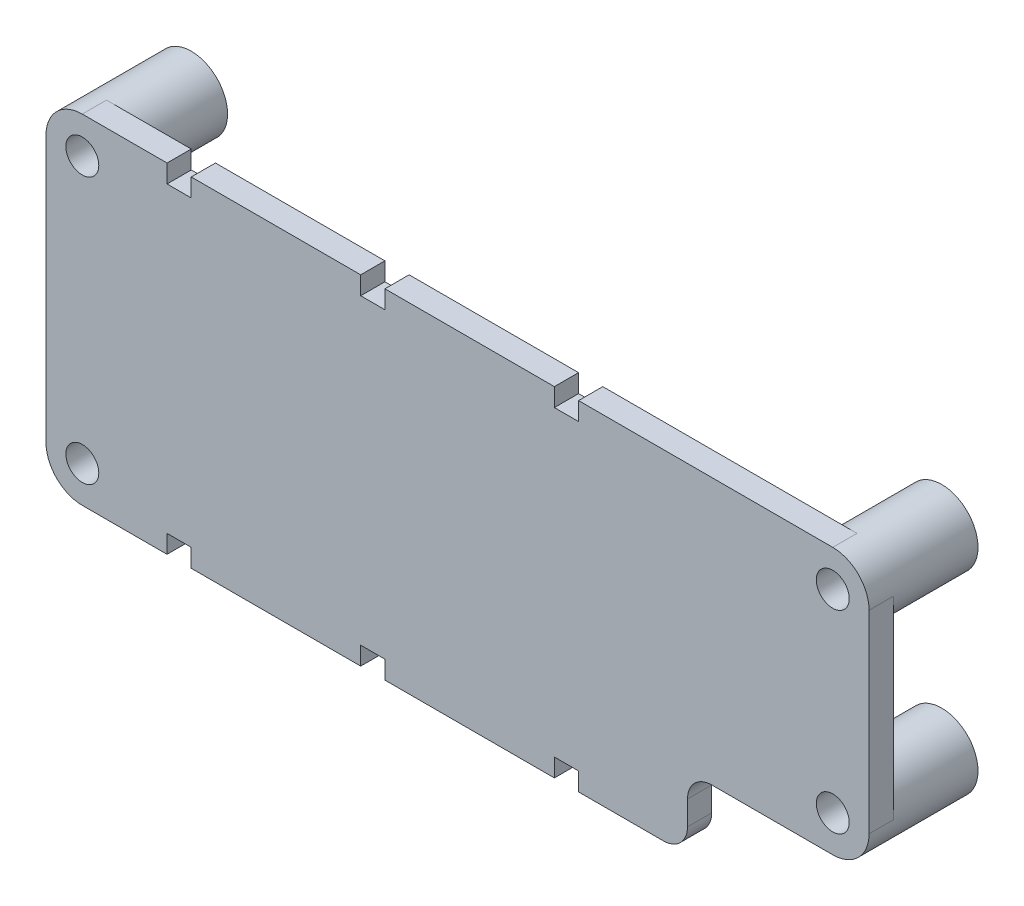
ISO-10303-21;
HEADER;
FILE_DESCRIPTION(('STEP AP214'),'2;1');
FILE_NAME('part.step','',(''),(''),'','','');
FILE_SCHEMA(('AUTOMOTIVE_DESIGN { 1 0 10303 214 1 1 1 1 }'));
ENDSEC;
DATA;
#1=APPLICATION_CONTEXT('core data for automotive mechanical design processes');
#2=APPLICATION_PROTOCOL_DEFINITION('international standard','automotive_design',2000,#1);
#3=PRODUCT_CONTEXT('',#1,'mechanical');
#4=PRODUCT('Part','Part','',(#3));
#5=PRODUCT_RELATED_PRODUCT_CATEGORY('part','',(#4));
#6=PRODUCT_DEFINITION_FORMATION('','',#4);
#7=PRODUCT_DEFINITION_CONTEXT('part definition',#1,'design');
#8=PRODUCT_DEFINITION('design','',#6,#7);
#9=PRODUCT_DEFINITION_SHAPE('','',#8);
#10=(LENGTH_UNIT() NAMED_UNIT(*) SI_UNIT(.MILLI.,.METRE.));
#11=(NAMED_UNIT(*) PLANE_ANGLE_UNIT() SI_UNIT($,.RADIAN.));
#12=(NAMED_UNIT(*) SI_UNIT($,.STERADIAN.) SOLID_ANGLE_UNIT());
#13=UNCERTAINTY_MEASURE_WITH_UNIT(LENGTH_MEASURE(1.E-05),#10,'distance_accuracy_value','');
#14=(GEOMETRIC_REPRESENTATION_CONTEXT(3) GLOBAL_UNCERTAINTY_ASSIGNED_CONTEXT((#13)) GLOBAL_UNIT_ASSIGNED_CONTEXT((#10,
#11,#12)) REPRESENTATION_CONTEXT('',''));
#15=CARTESIAN_POINT('',(0.,0.,0.));
#16=DIRECTION('',(0.,0.,1.));
#17=DIRECTION('',(1.,0.,0.));
#18=AXIS2_PLACEMENT_3D('',#15,#16,#17);
#19=CARTESIAN_POINT('',(-27.9400000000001,24.13,11.43));
#20=DIRECTION('',(0.,-1.,0.));
#21=DIRECTION('',(0.,0.,-1.));
#22=AXIS2_PLACEMENT_3D('',#19,#20,#21);
#23=PLANE('',#22);
#24=DIRECTION('',(-1.,0.,0.));
#25=VECTOR('',#24,1.);
#26=CARTESIAN_POINT('',(-27.9400000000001,24.13,11.43));
#27=LINE('',#26,#25);
#28=CARTESIAN_POINT('',(21.5899999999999,24.13,11.43));
#29=VERTEX_POINT('',#28);
#30=CARTESIAN_POINT('',(3.80999999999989,24.13,11.43));
#31=VERTEX_POINT('',#30);
#32=EDGE_CURVE('E465',#29,#31,#27,.T.);
#33=ORIENTED_EDGE('',*,*,#32,.F.);
#34=DIRECTION('',(0.,0.,1.));
#35=VECTOR('',#34,1.);
#36=CARTESIAN_POINT('',(21.5899999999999,24.13,5.715));
#37=LINE('',#36,#35);
#38=CARTESIAN_POINT('',(21.5899999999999,24.13,8.89));
#39=VERTEX_POINT('',#38);
#40=EDGE_CURVE('E297',#39,#29,#37,.T.);
#41=ORIENTED_EDGE('',*,*,#40,.F.);
#42=DIRECTION('',(-1.,0.,0.));
#43=VECTOR('',#42,1.);
#44=CARTESIAN_POINT('',(-27.9400000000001,24.13,8.89));
#45=LINE('',#44,#43);
#46=CARTESIAN_POINT('',(3.80999999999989,24.13,8.89));
#47=VERTEX_POINT('',#46);
#48=EDGE_CURVE('E37',#39,#47,#45,.T.);
#49=ORIENTED_EDGE('',*,*,#48,.T.);
#50=DIRECTION('',(0.,0.,1.));
#51=VECTOR('',#50,1.);
#52=CARTESIAN_POINT('',(3.80999999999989,24.13,5.715));
#53=LINE('',#52,#51);
#54=EDGE_CURVE('E363',#47,#31,#53,.T.);
#55=ORIENTED_EDGE('',*,*,#54,.T.);
#56=EDGE_LOOP('',(#33,#41,#49,#55));
#57=FACE_BOUND('',#56,.T.);
#58=ADVANCED_FACE('F33',(#57),#23,.F.);
#59=CARTESIAN_POINT('',(-27.9400000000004,-11.43,11.43));
#60=DIRECTION('',(0.,1.,0.));
#61=DIRECTION('',(0.,0.,1.));
#62=AXIS2_PLACEMENT_3D('',#59,#60,#61);
#63=PLANE('',#62);
#64=DIRECTION('',(1.,0.,0.));
#65=VECTOR('',#64,1.);
#66=CARTESIAN_POINT('',(-27.9400000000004,-11.43,8.89));
#67=LINE('',#66,#65);
#68=CARTESIAN_POINT('',(-16.5100000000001,-11.4299999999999,8.89));
#69=VERTEX_POINT('',#68);
#70=CARTESIAN_POINT('',(1.2699999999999,-11.4299999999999,8.89));
#71=VERTEX_POINT('',#70);
#72=EDGE_CURVE('E494',#69,#71,#67,.T.);
#73=ORIENTED_EDGE('',*,*,#72,.T.);
#74=DIRECTION('',(0.,0.,1.));
#75=VECTOR('',#74,1.);
#76=CARTESIAN_POINT('',(1.2699999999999,-11.4299999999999,5.715));
#77=LINE('',#76,#75);
#78=CARTESIAN_POINT('',(1.2699999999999,-11.4299999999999,11.43));
#79=VERTEX_POINT('',#78);
#80=EDGE_CURVE('E318',#71,#79,#77,.T.);
#81=ORIENTED_EDGE('',*,*,#80,.T.);
#82=DIRECTION('',(1.,0.,0.));
#83=VECTOR('',#82,1.);
#84=CARTESIAN_POINT('',(-27.9400000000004,-11.43,11.43));
#85=LINE('',#84,#83);
#86=CARTESIAN_POINT('',(-16.5100000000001,-11.43,11.43));
#87=VERTEX_POINT('',#86);
#88=EDGE_CURVE('E476',#87,#79,#85,.T.);
#89=ORIENTED_EDGE('',*,*,#88,.F.);
#90=DIRECTION('',(0.,0.,1.));
#91=VECTOR('',#90,1.);
#92=CARTESIAN_POINT('',(-16.5100000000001,-11.4299999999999,5.715));
#93=LINE('',#92,#91);
#94=EDGE_CURVE('E344',#69,#87,#93,.T.);
#95=ORIENTED_EDGE('',*,*,#94,.F.);
#96=EDGE_LOOP('',(#73,#81,#89,#95));
#97=FACE_BOUND('',#96,.T.);
#98=ADVANCED_FACE('F593',(#97),#63,.F.);
#99=CARTESIAN_POINT('',(-27.9400000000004,-11.4299999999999,8.89));
#100=VERTEX_POINT('',#99);
#101=CARTESIAN_POINT('',(-19.0500000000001,-11.4299999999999,8.89));
#102=VERTEX_POINT('',#101);
#103=EDGE_CURVE('E490',#100,#102,#67,.T.);
#104=ORIENTED_EDGE('',*,*,#103,.T.);
#105=DIRECTION('',(0.,0.,1.));
#106=VECTOR('',#105,1.);
#107=CARTESIAN_POINT('',(-19.0500000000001,-11.4299999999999,5.715));
#108=LINE('',#107,#106);
#109=CARTESIAN_POINT('',(-19.0500000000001,-11.4299999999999,11.43));
#110=VERTEX_POINT('',#109);
#111=EDGE_CURVE('E340',#102,#110,#108,.T.);
#112=ORIENTED_EDGE('',*,*,#111,.T.);
#113=CARTESIAN_POINT('',(-27.9400000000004,-11.4299999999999,11.43));
#114=VERTEX_POINT('',#113);
#115=EDGE_CURVE('E472',#114,#110,#85,.T.);
#116=ORIENTED_EDGE('',*,*,#115,.F.);
#117=DIRECTION('',(0.,0.,-1.));
#118=VECTOR('',#117,1.);
#119=CARTESIAN_POINT('',(-27.9400000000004,-11.4299999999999,11.43));
#120=LINE('',#119,#118);
#121=EDGE_CURVE('E527',#114,#100,#120,.T.);
#122=ORIENTED_EDGE('',*,*,#121,.T.);
#123=EDGE_LOOP('',(#104,#112,#116,#122));
#124=FACE_BOUND('',#123,.T.);
#125=ADVANCED_FACE('F706',(#124),#63,.F.);
#126=CARTESIAN_POINT('',(1.2699999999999,24.13,11.43));
#127=VERTEX_POINT('',#126);
#128=CARTESIAN_POINT('',(-16.5100000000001,24.13,11.43));
#129=VERTEX_POINT('',#128);
#130=EDGE_CURVE('E673',#127,#129,#27,.T.);
#131=ORIENTED_EDGE('',*,*,#130,.F.);
#132=DIRECTION('',(0.,0.,1.));
#133=VECTOR('',#132,1.);
#134=CARTESIAN_POINT('',(1.2699999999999,24.13,5.715));
#135=LINE('',#134,#133);
#136=CARTESIAN_POINT('',(1.2699999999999,24.13,8.89));
#137=VERTEX_POINT('',#136);
#138=EDGE_CURVE('E351',#137,#127,#135,.T.);
#139=ORIENTED_EDGE('',*,*,#138,.F.);
#140=CARTESIAN_POINT('',(-16.5100000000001,24.13,8.89));
#141=VERTEX_POINT('',#140);
#142=EDGE_CURVE('E553',#137,#141,#45,.T.);
#143=ORIENTED_EDGE('',*,*,#142,.T.);
#144=DIRECTION('',(0.,0.,1.));
#145=VECTOR('',#144,1.);
#146=CARTESIAN_POINT('',(-16.5100000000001,24.13,5.715));
#147=LINE('',#146,#145);
#148=EDGE_CURVE('E387',#141,#129,#147,.T.);
#149=ORIENTED_EDGE('',*,*,#148,.T.);
#150=EDGE_LOOP('',(#131,#139,#143,#149));
#151=FACE_BOUND('',#150,.T.);
#152=ADVANCED_FACE('F688',(#151),#23,.F.);
#153=CARTESIAN_POINT('',(-19.0500000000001,24.13,11.43));
#154=VERTEX_POINT('',#153);
#155=CARTESIAN_POINT('',(-27.9400000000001,24.13,11.43));
#156=VERTEX_POINT('',#155);
#157=EDGE_CURVE('E461',#154,#156,#27,.T.);
#158=ORIENTED_EDGE('',*,*,#157,.F.);
#159=DIRECTION('',(0.,0.,1.));
#160=VECTOR('',#159,1.);
#161=CARTESIAN_POINT('',(-19.0500000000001,24.13,5.715));
#162=LINE('',#161,#160);
#163=CARTESIAN_POINT('',(-19.0500000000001,24.13,8.89));
#164=VERTEX_POINT('',#163);
#165=EDGE_CURVE('E375',#164,#154,#162,.T.);
#166=ORIENTED_EDGE('',*,*,#165,.F.);
#167=CARTESIAN_POINT('',(-27.9400000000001,24.13,8.89));
#168=VERTEX_POINT('',#167);
#169=EDGE_CURVE('E456',#164,#168,#45,.T.);
#170=ORIENTED_EDGE('',*,*,#169,.T.);
#171=DIRECTION('',(0.,0.,-1.));
#172=VECTOR('',#171,1.);
#173=CARTESIAN_POINT('',(-27.9400000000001,24.13,11.43));
#174=LINE('',#173,#172);
#175=EDGE_CURVE('E537',#156,#168,#174,.T.);
#176=ORIENTED_EDGE('',*,*,#175,.F.);
#177=EDGE_LOOP('',(#158,#166,#170,#176));
#178=FACE_BOUND('',#177,.T.);
#179=ADVANCED_FACE('F563',(#178),#23,.F.);
#180=CARTESIAN_POINT('',(3.8099999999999,-11.43,11.43));
#181=VERTEX_POINT('',#180);
#182=CARTESIAN_POINT('',(21.5899999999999,-11.4299999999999,11.43));
#183=VERTEX_POINT('',#182);
#184=EDGE_CURVE('E477',#181,#183,#85,.T.);
#185=ORIENTED_EDGE('',*,*,#184,.F.);
#186=DIRECTION('',(0.,0.,1.));
#187=VECTOR('',#186,1.);
#188=CARTESIAN_POINT('',(3.8099999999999,-11.4299999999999,5.715));
#189=LINE('',#188,#187);
#190=CARTESIAN_POINT('',(3.8099999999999,-11.4299999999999,8.89));
#191=VERTEX_POINT('',#190);
#192=EDGE_CURVE('E59',#191,#181,#189,.T.);
#193=ORIENTED_EDGE('',*,*,#192,.F.);
#194=CARTESIAN_POINT('',(21.5899999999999,-11.4299999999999,8.89));
#195=VERTEX_POINT('',#194);
#196=EDGE_CURVE('E495',#191,#195,#67,.T.);
#197=ORIENTED_EDGE('',*,*,#196,.T.);
#198=DIRECTION('',(0.,0.,1.));
#199=VECTOR('',#198,1.);
#200=CARTESIAN_POINT('',(21.5899999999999,-11.4299999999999,5.715));
#201=LINE('',#200,#199);
#202=EDGE_CURVE('E412',#195,#183,#201,.T.);
#203=ORIENTED_EDGE('',*,*,#202,.T.);
#204=EDGE_LOOP('',(#185,#193,#197,#203));
#205=FACE_BOUND('',#204,.T.);
#206=ADVANCED_FACE('F720',(#205),#63,.F.);
#207=CARTESIAN_POINT('',(50.7999999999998,20.32,8.89));
#208=DIRECTION('',(0.,0.,1.));
#209=DIRECTION('',(1.,0.,0.));
#210=AXIS2_PLACEMENT_3D('',#207,#208,#209);
#211=PLANE('',#210);
#212=ORIENTED_EDGE('',*,*,#48,.F.);
#213=DIRECTION('',(0.,1.,0.));
#214=VECTOR('',#213,1.);
#215=CARTESIAN_POINT('',(21.5899999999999,24.13,8.89));
#216=LINE('',#215,#214);
#217=CARTESIAN_POINT('',(21.5899999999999,22.225,8.89));
#218=VERTEX_POINT('',#217);
#219=EDGE_CURVE('E303',#218,#39,#216,.T.);
#220=ORIENTED_EDGE('',*,*,#219,.F.);
#221=DIRECTION('',(-1.,0.,0.));
#222=VECTOR('',#221,1.);
#223=CARTESIAN_POINT('',(21.5899999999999,22.225,8.89));
#224=LINE('',#223,#222);
#225=CARTESIAN_POINT('',(24.1299999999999,22.225,8.89));
#226=VERTEX_POINT('',#225);
#227=EDGE_CURVE('E300',#226,#218,#224,.T.);
#228=ORIENTED_EDGE('',*,*,#227,.F.);
#229=DIRECTION('',(0.,-1.,0.));
#230=VECTOR('',#229,1.);
#231=CARTESIAN_POINT('',(24.1299999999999,24.13,8.89));
#232=LINE('',#231,#230);
#233=CARTESIAN_POINT('',(24.1299999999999,24.13,8.89));
#234=VERTEX_POINT('',#233);
#235=EDGE_CURVE('E277',#234,#226,#232,.T.);
#236=ORIENTED_EDGE('',*,*,#235,.F.);
#237=CARTESIAN_POINT('',(50.7999999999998,24.13,8.89));
#238=VERTEX_POINT('',#237);
#239=EDGE_CURVE('E542',#238,#234,#45,.T.);
#240=ORIENTED_EDGE('',*,*,#239,.F.);
#241=CARTESIAN_POINT('',(50.7999999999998,20.32,8.89));
#242=DIRECTION('',(0.,0.,1.));
#243=DIRECTION('',(1.,0.,0.));
#244=AXIS2_PLACEMENT_3D('',#241,#242,#243);
#245=CIRCLE('',#244,3.81);
#246=CARTESIAN_POINT('',(54.6099999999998,20.32,8.89));
#247=VERTEX_POINT('',#246);
#248=EDGE_CURVE('E449',#238,#247,#245,.T.);
#249=ORIENTED_EDGE('',*,*,#248,.T.);
#250=DIRECTION('',(0.,1.,0.));
#251=VECTOR('',#250,1.);
#252=CARTESIAN_POINT('',(54.6099999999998,20.32,8.89));
#253=LINE('',#252,#251);
#254=CARTESIAN_POINT('',(54.6099999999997,0.,8.89));
#255=VERTEX_POINT('',#254);
#256=EDGE_CURVE('E462',#255,#247,#253,.T.);
#257=ORIENTED_EDGE('',*,*,#256,.F.);
#258=CARTESIAN_POINT('',(50.7999999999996,0.,8.89));
#259=DIRECTION('',(0.,0.,1.));
#260=DIRECTION('',(1.,0.,0.));
#261=AXIS2_PLACEMENT_3D('',#258,#259,#260);
#262=CIRCLE('',#261,3.81);
#263=CARTESIAN_POINT('',(50.7999999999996,-3.81,8.89));
#264=VERTEX_POINT('',#263);
#265=EDGE_CURVE('E444',#255,#264,#262,.T.);
#266=ORIENTED_EDGE('',*,*,#265,.T.);
#267=DIRECTION('',(1.,0.,0.));
#268=VECTOR('',#267,1.);
#269=CARTESIAN_POINT('',(50.7999999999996,-3.81,8.89));
#270=LINE('',#269,#268);
#271=CARTESIAN_POINT('',(38.0999999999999,-3.81000000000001,8.89));
#272=VERTEX_POINT('',#271);
#273=EDGE_CURVE('E502',#272,#264,#270,.T.);
#274=ORIENTED_EDGE('',*,*,#273,.F.);
#275=CARTESIAN_POINT('',(38.0999999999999,-6.35000000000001,8.89));
#276=DIRECTION('',(0.,0.,-1.));
#277=DIRECTION('',(1.,0.,0.));
#278=AXIS2_PLACEMENT_3D('',#275,#276,#277);
#279=CIRCLE('',#278,2.54);
#280=CARTESIAN_POINT('',(35.5599999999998,-6.35000000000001,8.89));
#281=VERTEX_POINT('',#280);
#282=EDGE_CURVE('E500',#281,#272,#279,.T.);
#283=ORIENTED_EDGE('',*,*,#282,.F.);
#284=DIRECTION('',(0.,1.,0.));
#285=VECTOR('',#284,1.);
#286=CARTESIAN_POINT('',(35.5599999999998,-6.35000000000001,8.89));
#287=LINE('',#286,#285);
#288=CARTESIAN_POINT('',(35.5599999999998,-8.89,8.89));
#289=VERTEX_POINT('',#288);
#290=EDGE_CURVE('E498',#289,#281,#287,.T.);
#291=ORIENTED_EDGE('',*,*,#290,.F.);
#292=CARTESIAN_POINT('',(33.0199999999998,-8.89000000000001,8.89));
#293=DIRECTION('',(0.,0.,1.));
#294=DIRECTION('',(1.,0.,0.));
#295=AXIS2_PLACEMENT_3D('',#292,#293,#294);
#296=CIRCLE('',#295,2.54);
#297=CARTESIAN_POINT('',(33.0199999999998,-11.43,8.89));
#298=VERTEX_POINT('',#297);
#299=EDGE_CURVE('E493',#298,#289,#296,.T.);
#300=ORIENTED_EDGE('',*,*,#299,.F.);
#301=CARTESIAN_POINT('',(24.1299999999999,-11.4299999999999,8.89));
#302=VERTEX_POINT('',#301);
#303=EDGE_CURVE('E496',#302,#298,#67,.T.);
#304=ORIENTED_EDGE('',*,*,#303,.F.);
#305=DIRECTION('',(0.,-1.,0.));
#306=VECTOR('',#305,1.);
#307=CARTESIAN_POINT('',(24.1299999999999,-11.4299999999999,8.89));
#308=LINE('',#307,#306);
#309=CARTESIAN_POINT('',(24.1299999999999,-9.52499999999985,8.89));
#310=VERTEX_POINT('',#309);
#311=EDGE_CURVE('E396',#310,#302,#308,.T.);
#312=ORIENTED_EDGE('',*,*,#311,.F.);
#313=DIRECTION('',(1.,0.,0.));
#314=VECTOR('',#313,1.);
#315=CARTESIAN_POINT('',(21.5899999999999,-9.52499999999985,8.89));
#316=LINE('',#315,#314);
#317=CARTESIAN_POINT('',(21.5899999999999,-9.52499999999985,8.89));
#318=VERTEX_POINT('',#317);
#319=EDGE_CURVE('E398',#318,#310,#316,.T.);
#320=ORIENTED_EDGE('',*,*,#319,.F.);
#321=DIRECTION('',(0.,1.,0.));
#322=VECTOR('',#321,1.);
#323=CARTESIAN_POINT('',(21.5899999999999,-11.4299999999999,8.89));
#324=LINE('',#323,#322);
#325=EDGE_CURVE('E401',#195,#318,#324,.T.);
#326=ORIENTED_EDGE('',*,*,#325,.F.);
#327=ORIENTED_EDGE('',*,*,#196,.F.);
#328=DIRECTION('',(0.,-1.,0.));
#329=VECTOR('',#328,1.);
#330=CARTESIAN_POINT('',(3.8099999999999,-11.4299999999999,8.89));
#331=LINE('',#330,#329);
#332=CARTESIAN_POINT('',(3.8099999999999,-9.52499999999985,8.89));
#333=VERTEX_POINT('',#332);
#334=EDGE_CURVE('E304',#333,#191,#331,.T.);
#335=ORIENTED_EDGE('',*,*,#334,.F.);
#336=DIRECTION('',(1.,0.,0.));
#337=VECTOR('',#336,1.);
#338=CARTESIAN_POINT('',(1.2699999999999,-9.52499999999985,8.89));
#339=LINE('',#338,#337);
#340=CARTESIAN_POINT('',(1.2699999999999,-9.52499999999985,8.89));
#341=VERTEX_POINT('',#340);
#342=EDGE_CURVE('E306',#341,#333,#339,.T.);
#343=ORIENTED_EDGE('',*,*,#342,.F.);
#344=DIRECTION('',(0.,1.,0.));
#345=VECTOR('',#344,1.);
#346=CARTESIAN_POINT('',(1.2699999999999,-11.4299999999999,8.89));
#347=LINE('',#346,#345);
#348=EDGE_CURVE('E309',#71,#341,#347,.T.);
#349=ORIENTED_EDGE('',*,*,#348,.F.);
#350=ORIENTED_EDGE('',*,*,#72,.F.);
#351=DIRECTION('',(0.,-1.,0.));
#352=VECTOR('',#351,1.);
#353=CARTESIAN_POINT('',(-16.5100000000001,-11.4299999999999,8.89));
#354=LINE('',#353,#352);
#355=CARTESIAN_POINT('',(-16.5100000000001,-9.52499999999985,8.89));
#356=VERTEX_POINT('',#355);
#357=EDGE_CURVE('E325',#356,#69,#354,.T.);
#358=ORIENTED_EDGE('',*,*,#357,.F.);
#359=DIRECTION('',(1.,0.,0.));
#360=VECTOR('',#359,1.);
#361=CARTESIAN_POINT('',(-19.0500000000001,-9.52499999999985,8.89));
#362=LINE('',#361,#360);
#363=CARTESIAN_POINT('',(-19.0500000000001,-9.52499999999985,8.89));
#364=VERTEX_POINT('',#363);
#365=EDGE_CURVE('E327',#364,#356,#362,.T.);
#366=ORIENTED_EDGE('',*,*,#365,.F.);
#367=DIRECTION('',(0.,1.,0.));
#368=VECTOR('',#367,1.);
#369=CARTESIAN_POINT('',(-19.0500000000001,-11.4299999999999,8.89));
#370=LINE('',#369,#368);
#371=EDGE_CURVE('E330',#102,#364,#370,.T.);
#372=ORIENTED_EDGE('',*,*,#371,.F.);
#373=ORIENTED_EDGE('',*,*,#103,.F.);
#374=CARTESIAN_POINT('',(-27.9400000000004,-7.62000000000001,8.89));
#375=DIRECTION('',(0.,0.,1.));
#376=DIRECTION('',(1.,0.,0.));
#377=AXIS2_PLACEMENT_3D('',#374,#375,#376);
#378=CIRCLE('',#377,3.81);
#379=CARTESIAN_POINT('',(-31.7500000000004,-7.62000000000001,8.89));
#380=VERTEX_POINT('',#379);
#381=EDGE_CURVE('E454',#100,#380,#378,.T.);
#382=ORIENTED_EDGE('',*,*,#381,.T.);
#383=DIRECTION('',(0.,-1.,0.));
#384=VECTOR('',#383,1.);
#385=CARTESIAN_POINT('',(-31.7500000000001,20.32,8.89));
#386=LINE('',#385,#384);
#387=CARTESIAN_POINT('',(-31.7500000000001,20.32,8.89));
#388=VERTEX_POINT('',#387);
#389=EDGE_CURVE('E544',#388,#380,#386,.T.);
#390=ORIENTED_EDGE('',*,*,#389,.F.);
#391=CARTESIAN_POINT('',(-27.9400000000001,20.32,8.89));
#392=DIRECTION('',(0.,0.,1.));
#393=DIRECTION('',(1.,0.,0.));
#394=AXIS2_PLACEMENT_3D('',#391,#392,#393);
#395=CIRCLE('',#394,3.81);
#396=EDGE_CURVE('E11',#388,#168,#395,.T.);
#397=ORIENTED_EDGE('',*,*,#396,.T.);
#398=ORIENTED_EDGE('',*,*,#169,.F.);
#399=DIRECTION('',(0.,1.,0.));
#400=VECTOR('',#399,1.);
#401=CARTESIAN_POINT('',(-19.0500000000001,24.13,8.89));
#402=LINE('',#401,#400);
#403=CARTESIAN_POINT('',(-19.0500000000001,22.225,8.89));
#404=VERTEX_POINT('',#403);
#405=EDGE_CURVE('E374',#404,#164,#402,.T.);
#406=ORIENTED_EDGE('',*,*,#405,.F.);
#407=DIRECTION('',(-1.,0.,0.));
#408=VECTOR('',#407,1.);
#409=CARTESIAN_POINT('',(-19.0500000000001,22.225,8.89));
#410=LINE('',#409,#408);
#411=CARTESIAN_POINT('',(-16.5100000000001,22.225,8.89));
#412=VERTEX_POINT('',#411);
#413=EDGE_CURVE('E377',#412,#404,#410,.T.);
#414=ORIENTED_EDGE('',*,*,#413,.F.);
#415=DIRECTION('',(0.,-1.,0.));
#416=VECTOR('',#415,1.);
#417=CARTESIAN_POINT('',(-16.5100000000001,24.13,8.89));
#418=LINE('',#417,#416);
#419=EDGE_CURVE('E372',#141,#412,#418,.T.);
#420=ORIENTED_EDGE('',*,*,#419,.F.);
#421=ORIENTED_EDGE('',*,*,#142,.F.);
#422=DIRECTION('',(0.,1.,0.));
#423=VECTOR('',#422,1.);
#424=CARTESIAN_POINT('',(1.2699999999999,24.13,8.89));
#425=LINE('',#424,#423);
#426=CARTESIAN_POINT('',(1.2699999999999,22.225,8.89));
#427=VERTEX_POINT('',#426);
#428=EDGE_CURVE('E350',#427,#137,#425,.T.);
#429=ORIENTED_EDGE('',*,*,#428,.F.);
#430=DIRECTION('',(-1.,0.,0.));
#431=VECTOR('',#430,1.);
#432=CARTESIAN_POINT('',(1.2699999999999,22.225,8.89));
#433=LINE('',#432,#431);
#434=CARTESIAN_POINT('',(3.80999999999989,22.225,8.89));
#435=VERTEX_POINT('',#434);
#436=EDGE_CURVE('E353',#435,#427,#433,.T.);
#437=ORIENTED_EDGE('',*,*,#436,.F.);
#438=DIRECTION('',(0.,-1.,0.));
#439=VECTOR('',#438,1.);
#440=CARTESIAN_POINT('',(3.80999999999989,24.13,8.89));
#441=LINE('',#440,#439);
#442=EDGE_CURVE('E348',#47,#435,#441,.T.);
#443=ORIENTED_EDGE('',*,*,#442,.F.);
#444=EDGE_LOOP('',(#212,#220,#228,#236,#240,#249,#257,#266,#274,#283,#291,#300,#304,#312,#320,
#326,#327,#335,#343,#349,#350,#358,#366,#372,#373,#382,#390,#397,#398,#406,#414,#420,#421,#429,
#437,#443));
#445=FACE_BOUND('',#444,.T.);
#446=ADVANCED_FACE('F570',(#445),#211,.F.);
#447=CARTESIAN_POINT('',(-27.9400000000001,20.32,8.89));
#448=DIRECTION('',(0.,0.,-1.));
#449=DIRECTION('',(-1.,0.,0.));
#450=AXIS2_PLACEMENT_3D('',#447,#448,#449);
#451=CYLINDRICAL_SURFACE('',#450,3.81);
#452=ORIENTED_EDGE('',*,*,#396,.F.);
#453=DIRECTION('',(0.,0.,-1.));
#454=VECTOR('',#453,1.);
#455=CARTESIAN_POINT('',(-31.7500000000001,20.32,11.43));
#456=LINE('',#455,#454);
#457=CARTESIAN_POINT('',(-31.7500000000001,20.32,11.43));
#458=VERTEX_POINT('',#457);
#459=EDGE_CURVE('E533',#458,#388,#456,.T.);
#460=ORIENTED_EDGE('',*,*,#459,.F.);
#461=CARTESIAN_POINT('',(-27.9400000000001,20.32,11.43));
#462=DIRECTION('',(0.,0.,1.));
#463=DIRECTION('',(1.,0.,0.));
#464=AXIS2_PLACEMENT_3D('',#461,#462,#463);
#465=CIRCLE('',#464,3.81);
#466=EDGE_CURVE('E464',#156,#458,#465,.T.);
#467=ORIENTED_EDGE('',*,*,#466,.F.);
#468=ORIENTED_EDGE('',*,*,#175,.T.);
#469=EDGE_LOOP('',(#452,#460,#467,#468));
#470=FACE_BOUND('',#469,.T.);
#471=CARTESIAN_POINT('',(-27.9400000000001,20.32,0.));
#472=DIRECTION('',(0.,0.,1.));
#473=DIRECTION('',(1.,0.,0.));
#474=AXIS2_PLACEMENT_3D('',#471,#472,#473);
#475=CIRCLE('',#474,3.81);
#476=CARTESIAN_POINT('',(-24.1300000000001,20.32,0.));
#477=VERTEX_POINT('',#476);
#478=EDGE_CURVE('E43',#477,#477,#475,.T.);
#479=ORIENTED_EDGE('',*,*,#478,.T.);
#480=EDGE_LOOP('',(#479));
#481=FACE_BOUND('',#480,.T.);
#482=ADVANCED_FACE('F35',(#470,#481),#451,.T.);
#483=CARTESIAN_POINT('',(-27.9400000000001,20.32,0.));
#484=DIRECTION('',(0.,0.,1.));
#485=DIRECTION('',(1.,0.,0.));
#486=AXIS2_PLACEMENT_3D('',#483,#484,#485);
#487=PLANE('',#486);
#488=CARTESIAN_POINT('',(-27.9400000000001,20.32,0.));
#489=DIRECTION('',(0.,0.,1.));
#490=DIRECTION('',(1.,0.,0.));
#491=AXIS2_PLACEMENT_3D('',#488,#489,#490);
#492=CIRCLE('',#491,1.7272);
#493=CARTESIAN_POINT('',(-26.2128000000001,20.32,0.));
#494=VERTEX_POINT('',#493);
#495=EDGE_CURVE('E422',#494,#494,#492,.T.);
#496=ORIENTED_EDGE('',*,*,#495,.T.);
#497=EDGE_LOOP('',(#496));
#498=FACE_BOUND('',#497,.T.);
#499=ORIENTED_EDGE('',*,*,#478,.F.);
#500=EDGE_LOOP('',(#499));
#501=FACE_BOUND('',#500,.T.);
#502=ADVANCED_FACE('F718',(#498,#501),#487,.F.);
#503=CARTESIAN_POINT('',(50.7999999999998,20.32,11.43));
#504=DIRECTION('',(0.,0.,-1.));
#505=DIRECTION('',(-1.,0.,0.));
#506=AXIS2_PLACEMENT_3D('',#503,#504,#505);
#507=CYLINDRICAL_SURFACE('',#506,3.81);
#508=DIRECTION('',(0.,0.,-1.));
#509=VECTOR('',#508,1.);
#510=CARTESIAN_POINT('',(54.6099999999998,20.32,11.43));
#511=LINE('',#510,#509);
#512=CARTESIAN_POINT('',(54.6099999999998,20.32,11.43));
#513=VERTEX_POINT('',#512);
#514=EDGE_CURVE('E489',#513,#247,#511,.T.);
#515=ORIENTED_EDGE('',*,*,#514,.T.);
#516=ORIENTED_EDGE('',*,*,#248,.F.);
#517=DIRECTION('',(0.,0.,-1.));
#518=VECTOR('',#517,1.);
#519=CARTESIAN_POINT('',(50.7999999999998,24.13,11.43));
#520=LINE('',#519,#518);
#521=CARTESIAN_POINT('',(50.7999999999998,24.13,11.43));
#522=VERTEX_POINT('',#521);
#523=EDGE_CURVE('E534',#522,#238,#520,.T.);
#524=ORIENTED_EDGE('',*,*,#523,.F.);
#525=CARTESIAN_POINT('',(50.7999999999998,20.32,11.43));
#526=DIRECTION('',(0.,0.,1.));
#527=DIRECTION('',(1.,0.,0.));
#528=AXIS2_PLACEMENT_3D('',#525,#526,#527);
#529=CIRCLE('',#528,3.81);
#530=EDGE_CURVE('E459',#513,#522,#529,.T.);
#531=ORIENTED_EDGE('',*,*,#530,.F.);
#532=EDGE_LOOP('',(#515,#516,#524,#531));
#533=FACE_BOUND('',#532,.T.);
#534=CARTESIAN_POINT('',(50.7999999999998,20.32,0.));
#535=DIRECTION('',(0.,0.,1.));
#536=DIRECTION('',(1.,0.,0.));
#537=AXIS2_PLACEMENT_3D('',#534,#535,#536);
#538=CIRCLE('',#537,3.81);
#539=CARTESIAN_POINT('',(54.6099999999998,20.32,0.));
#540=VERTEX_POINT('',#539);
#541=EDGE_CURVE('E446',#540,#540,#538,.T.);
#542=ORIENTED_EDGE('',*,*,#541,.T.);
#543=EDGE_LOOP('',(#542));
#544=FACE_BOUND('',#543,.T.);
#545=ADVANCED_FACE('F648',(#533,#544),#507,.T.);
#546=ORIENTED_EDGE('',*,*,#239,.T.);
#547=DIRECTION('',(0.,0.,1.));
#548=VECTOR('',#547,1.);
#549=CARTESIAN_POINT('',(24.1299999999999,24.13,5.715));
#550=LINE('',#549,#548);
#551=CARTESIAN_POINT('',(24.1299999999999,24.13,11.43));
#552=VERTEX_POINT('',#551);
#553=EDGE_CURVE('E280',#234,#552,#550,.T.);
#554=ORIENTED_EDGE('',*,*,#553,.T.);
#555=EDGE_CURVE('E292',#522,#552,#27,.T.);
#556=ORIENTED_EDGE('',*,*,#555,.F.);
#557=ORIENTED_EDGE('',*,*,#523,.T.);
#558=EDGE_LOOP('',(#546,#554,#556,#557));
#559=FACE_BOUND('',#558,.T.);
#560=ADVANCED_FACE('F652',(#559),#23,.F.);
#561=CARTESIAN_POINT('',(-31.7500000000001,20.32,11.43));
#562=DIRECTION('',(1.,0.,0.));
#563=DIRECTION('',(0.,1.,0.));
#564=AXIS2_PLACEMENT_3D('',#561,#562,#563);
#565=PLANE('',#564);
#566=ORIENTED_EDGE('',*,*,#389,.T.);
#567=DIRECTION('',(0.,0.,-1.));
#568=VECTOR('',#567,1.);
#569=CARTESIAN_POINT('',(-31.7500000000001,-7.62000000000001,11.43));
#570=LINE('',#569,#568);
#571=CARTESIAN_POINT('',(-31.7500000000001,-7.62000000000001,11.43));
#572=VERTEX_POINT('',#571);
#573=EDGE_CURVE('E530',#572,#380,#570,.T.);
#574=ORIENTED_EDGE('',*,*,#573,.F.);
#575=DIRECTION('',(0.,-1.,0.));
#576=VECTOR('',#575,1.);
#577=CARTESIAN_POINT('',(-31.7500000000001,20.32,11.43));
#578=LINE('',#577,#576);
#579=EDGE_CURVE('E467',#458,#572,#578,.T.);
#580=ORIENTED_EDGE('',*,*,#579,.F.);
#581=ORIENTED_EDGE('',*,*,#459,.T.);
#582=EDGE_LOOP('',(#566,#574,#580,#581));
#583=FACE_BOUND('',#582,.T.);
#584=ADVANCED_FACE('F712',(#583),#565,.F.);
#585=CARTESIAN_POINT('',(-27.9400000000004,-7.62000000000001,11.43));
#586=DIRECTION('',(0.,0.,-1.));
#587=DIRECTION('',(-1.,0.,0.));
#588=AXIS2_PLACEMENT_3D('',#585,#586,#587);
#589=CYLINDRICAL_SURFACE('',#588,3.80999999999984);
#590=ORIENTED_EDGE('',*,*,#573,.T.);
#591=ORIENTED_EDGE('',*,*,#381,.F.);
#592=ORIENTED_EDGE('',*,*,#121,.F.);
#593=CARTESIAN_POINT('',(-27.9400000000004,-7.62000000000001,11.43));
#594=DIRECTION('',(0.,0.,1.));
#595=DIRECTION('',(1.,0.,0.));
#596=AXIS2_PLACEMENT_3D('',#593,#594,#595);
#597=CIRCLE('',#596,3.80999999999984);
#598=EDGE_CURVE('E469',#572,#114,#597,.T.);
#599=ORIENTED_EDGE('',*,*,#598,.F.);
#600=EDGE_LOOP('',(#590,#591,#592,#599));
#601=FACE_BOUND('',#600,.T.);
#602=CARTESIAN_POINT('',(-27.9400000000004,-7.62000000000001,0.));
#603=DIRECTION('',(0.,0.,1.));
#604=DIRECTION('',(1.,0.,0.));
#605=AXIS2_PLACEMENT_3D('',#602,#603,#604);
#606=CIRCLE('',#605,3.81);
#607=CARTESIAN_POINT('',(-24.1300000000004,-7.62000000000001,0.));
#608=VERTEX_POINT('',#607);
#609=EDGE_CURVE('E451',#608,#608,#606,.T.);
#610=ORIENTED_EDGE('',*,*,#609,.T.);
#611=EDGE_LOOP('',(#610));
#612=FACE_BOUND('',#611,.T.);
#613=ADVANCED_FACE('F717',(#601,#612),#589,.T.);
#614=CARTESIAN_POINT('',(24.1299999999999,-11.43,11.43));
#615=VERTEX_POINT('',#614);
#616=CARTESIAN_POINT('',(33.0199999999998,-11.43,11.43));
#617=VERTEX_POINT('',#616);
#618=EDGE_CURVE('E471',#615,#617,#85,.T.);
#619=ORIENTED_EDGE('',*,*,#618,.F.);
#620=DIRECTION('',(0.,0.,1.));
#621=VECTOR('',#620,1.);
#622=CARTESIAN_POINT('',(24.1299999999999,-11.4299999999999,5.715));
#623=LINE('',#622,#621);
#624=EDGE_CURVE('E416',#302,#615,#623,.T.);
#625=ORIENTED_EDGE('',*,*,#624,.F.);
#626=ORIENTED_EDGE('',*,*,#303,.T.);
#627=DIRECTION('',(0.,0.,-1.));
#628=VECTOR('',#627,1.);
#629=CARTESIAN_POINT('',(33.0199999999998,-11.43,11.43));
#630=LINE('',#629,#628);
#631=EDGE_CURVE('E524',#617,#298,#630,.T.);
#632=ORIENTED_EDGE('',*,*,#631,.F.);
#633=EDGE_LOOP('',(#619,#625,#626,#632));
#634=FACE_BOUND('',#633,.T.);
#635=ADVANCED_FACE('F616',(#634),#63,.F.);
#636=CARTESIAN_POINT('',(33.0199999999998,-8.89000000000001,11.43));
#637=DIRECTION('',(0.,0.,-1.));
#638=DIRECTION('',(-1.,0.,0.));
#639=AXIS2_PLACEMENT_3D('',#636,#637,#638);
#640=CYLINDRICAL_SURFACE('',#639,2.54);
#641=ORIENTED_EDGE('',*,*,#299,.T.);
#642=DIRECTION('',(0.,0.,-1.));
#643=VECTOR('',#642,1.);
#644=CARTESIAN_POINT('',(35.5599999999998,-8.89,11.43));
#645=LINE('',#644,#643);
#646=CARTESIAN_POINT('',(35.5599999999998,-8.89,11.43));
#647=VERTEX_POINT('',#646);
#648=EDGE_CURVE('E521',#647,#289,#645,.T.);
#649=ORIENTED_EDGE('',*,*,#648,.F.);
#650=CARTESIAN_POINT('',(33.0199999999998,-8.89000000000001,11.43));
#651=DIRECTION('',(0.,0.,1.));
#652=DIRECTION('',(1.,0.,0.));
#653=AXIS2_PLACEMENT_3D('',#650,#651,#652);
#654=CIRCLE('',#653,2.54);
#655=EDGE_CURVE('E475',#617,#647,#654,.T.);
#656=ORIENTED_EDGE('',*,*,#655,.F.);
#657=ORIENTED_EDGE('',*,*,#631,.T.);
#658=EDGE_LOOP('',(#641,#649,#656,#657));
#659=FACE_BOUND('',#658,.T.);
#660=ADVANCED_FACE('F619',(#659),#640,.T.);
#661=CARTESIAN_POINT('',(35.5599999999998,-6.35000000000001,11.43));
#662=DIRECTION('',(-1.,0.,0.));
#663=DIRECTION('',(0.,0.,1.));
#664=AXIS2_PLACEMENT_3D('',#661,#662,#663);
#665=PLANE('',#664);
#666=ORIENTED_EDGE('',*,*,#290,.T.);
#667=DIRECTION('',(0.,0.,-1.));
#668=VECTOR('',#667,1.);
#669=CARTESIAN_POINT('',(35.5599999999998,-6.35000000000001,11.43));
#670=LINE('',#669,#668);
#671=CARTESIAN_POINT('',(35.5599999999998,-6.35000000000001,11.43));
#672=VERTEX_POINT('',#671);
#673=EDGE_CURVE('E518',#672,#281,#670,.T.);
#674=ORIENTED_EDGE('',*,*,#673,.F.);
#675=DIRECTION('',(0.,1.,0.));
#676=VECTOR('',#675,1.);
#677=CARTESIAN_POINT('',(35.5599999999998,-6.35000000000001,11.43));
#678=LINE('',#677,#676);
#679=EDGE_CURVE('E479',#647,#672,#678,.T.);
#680=ORIENTED_EDGE('',*,*,#679,.F.);
#681=ORIENTED_EDGE('',*,*,#648,.T.);
#682=EDGE_LOOP('',(#666,#674,#680,#681));
#683=FACE_BOUND('',#682,.T.);
#684=ADVANCED_FACE('F624',(#683),#665,.F.);
#685=CARTESIAN_POINT('',(38.0999999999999,-6.35000000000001,11.43));
#686=DIRECTION('',(0.,0.,-1.));
#687=DIRECTION('',(-1.,0.,0.));
#688=AXIS2_PLACEMENT_3D('',#685,#686,#687);
#689=CYLINDRICAL_SURFACE('',#688,2.54);
#690=ORIENTED_EDGE('',*,*,#282,.T.);
#691=DIRECTION('',(0.,0.,-1.));
#692=VECTOR('',#691,1.);
#693=CARTESIAN_POINT('',(38.0999999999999,-3.81000000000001,11.43));
#694=LINE('',#693,#692);
#695=CARTESIAN_POINT('',(38.0999999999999,-3.81000000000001,11.43));
#696=VERTEX_POINT('',#695);
#697=EDGE_CURVE('E515',#696,#272,#694,.T.);
#698=ORIENTED_EDGE('',*,*,#697,.F.);
#699=CARTESIAN_POINT('',(38.0999999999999,-6.35000000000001,11.43));
#700=DIRECTION('',(0.,0.,-1.));
#701=DIRECTION('',(1.,0.,0.));
#702=AXIS2_PLACEMENT_3D('',#699,#700,#701);
#703=CIRCLE('',#702,2.54);
#704=EDGE_CURVE('E481',#672,#696,#703,.T.);
#705=ORIENTED_EDGE('',*,*,#704,.F.);
#706=ORIENTED_EDGE('',*,*,#673,.T.);
#707=EDGE_LOOP('',(#690,#698,#705,#706));
#708=FACE_BOUND('',#707,.T.);
#709=ADVANCED_FACE('F630',(#708),#689,.F.);
#710=CARTESIAN_POINT('',(50.7999999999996,-3.81,11.43));
#711=DIRECTION('',(0.,1.,0.));
#712=DIRECTION('',(-1.,0.,0.));
#713=AXIS2_PLACEMENT_3D('',#710,#711,#712);
#714=PLANE('',#713);
#715=ORIENTED_EDGE('',*,*,#273,.T.);
#716=DIRECTION('',(0.,0.,-1.));
#717=VECTOR('',#716,1.);
#718=CARTESIAN_POINT('',(50.7999999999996,-3.81,11.43));
#719=LINE('',#718,#717);
#720=CARTESIAN_POINT('',(50.7999999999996,-3.81,11.43));
#721=VERTEX_POINT('',#720);
#722=EDGE_CURVE('E512',#721,#264,#719,.T.);
#723=ORIENTED_EDGE('',*,*,#722,.F.);
#724=DIRECTION('',(1.,0.,0.));
#725=VECTOR('',#724,1.);
#726=CARTESIAN_POINT('',(50.7999999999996,-3.81,11.43));
#727=LINE('',#726,#725);
#728=EDGE_CURVE('E483',#696,#721,#727,.T.);
#729=ORIENTED_EDGE('',*,*,#728,.F.);
#730=ORIENTED_EDGE('',*,*,#697,.T.);
#731=EDGE_LOOP('',(#715,#723,#729,#730));
#732=FACE_BOUND('',#731,.T.);
#733=ADVANCED_FACE('F634',(#732),#714,.F.);
#734=CARTESIAN_POINT('',(50.7999999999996,0.,11.43));
#735=DIRECTION('',(0.,0.,-1.));
#736=DIRECTION('',(-1.,0.,0.));
#737=AXIS2_PLACEMENT_3D('',#734,#735,#736);
#738=CYLINDRICAL_SURFACE('',#737,3.81000000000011);
#739=ORIENTED_EDGE('',*,*,#722,.T.);
#740=ORIENTED_EDGE('',*,*,#265,.F.);
#741=DIRECTION('',(0.,0.,-1.));
#742=VECTOR('',#741,1.);
#743=CARTESIAN_POINT('',(54.6099999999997,0.,11.43));
#744=LINE('',#743,#742);
#745=CARTESIAN_POINT('',(54.6099999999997,0.,11.43));
#746=VERTEX_POINT('',#745);
#747=EDGE_CURVE('E509',#746,#255,#744,.T.);
#748=ORIENTED_EDGE('',*,*,#747,.F.);
#749=CARTESIAN_POINT('',(50.7999999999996,0.,11.43));
#750=DIRECTION('',(0.,0.,1.));
#751=DIRECTION('',(1.,0.,0.));
#752=AXIS2_PLACEMENT_3D('',#749,#750,#751);
#753=CIRCLE('',#752,3.81000000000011);
#754=EDGE_CURVE('E485',#721,#746,#753,.T.);
#755=ORIENTED_EDGE('',*,*,#754,.F.);
#756=EDGE_LOOP('',(#739,#740,#748,#755));
#757=FACE_BOUND('',#756,.T.);
#758=CARTESIAN_POINT('',(50.7999999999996,0.,0.));
#759=DIRECTION('',(0.,0.,1.));
#760=DIRECTION('',(1.,0.,0.));
#761=AXIS2_PLACEMENT_3D('',#758,#759,#760);
#762=CIRCLE('',#761,3.81);
#763=CARTESIAN_POINT('',(54.6099999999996,0.,0.));
#764=VERTEX_POINT('',#763);
#765=EDGE_CURVE('E443',#764,#764,#762,.T.);
#766=ORIENTED_EDGE('',*,*,#765,.T.);
#767=EDGE_LOOP('',(#766));
#768=FACE_BOUND('',#767,.T.);
#769=ADVANCED_FACE('F638',(#757,#768),#738,.T.);
#770=CARTESIAN_POINT('',(54.6099999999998,20.32,11.43));
#771=DIRECTION('',(-1.,0.,0.));
#772=DIRECTION('',(0.,-1.,0.));
#773=AXIS2_PLACEMENT_3D('',#770,#771,#772);
#774=PLANE('',#773);
#775=ORIENTED_EDGE('',*,*,#256,.T.);
#776=ORIENTED_EDGE('',*,*,#514,.F.);
#777=DIRECTION('',(0.,1.,0.));
#778=VECTOR('',#777,1.);
#779=CARTESIAN_POINT('',(54.6099999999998,20.32,11.43));
#780=LINE('',#779,#778);
#781=EDGE_CURVE('E487',#746,#513,#780,.T.);
#782=ORIENTED_EDGE('',*,*,#781,.F.);
#783=ORIENTED_EDGE('',*,*,#747,.T.);
#784=EDGE_LOOP('',(#775,#776,#782,#783));
#785=FACE_BOUND('',#784,.T.);
#786=ADVANCED_FACE('F645',(#785),#774,.F.);
#787=CARTESIAN_POINT('',(50.7999999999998,20.32,11.43));
#788=DIRECTION('',(0.,0.,1.));
#789=DIRECTION('',(1.,0.,0.));
#790=AXIS2_PLACEMENT_3D('',#787,#788,#789);
#791=PLANE('',#790);
#792=DIRECTION('',(0.,-1.,0.));
#793=VECTOR('',#792,1.);
#794=CARTESIAN_POINT('',(21.5899999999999,24.13,11.43));
#795=LINE('',#794,#793);
#796=CARTESIAN_POINT('',(21.5899999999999,22.225,11.43));
#797=VERTEX_POINT('',#796);
#798=EDGE_CURVE('E51',#29,#797,#795,.T.);
#799=ORIENTED_EDGE('',*,*,#798,.F.);
#800=ORIENTED_EDGE('',*,*,#32,.T.);
#801=DIRECTION('',(0.,1.,0.));
#802=VECTOR('',#801,1.);
#803=CARTESIAN_POINT('',(3.80999999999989,24.13,11.43));
#804=LINE('',#803,#802);
#805=CARTESIAN_POINT('',(3.80999999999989,22.225,11.43));
#806=VERTEX_POINT('',#805);
#807=EDGE_CURVE('E358',#806,#31,#804,.T.);
#808=ORIENTED_EDGE('',*,*,#807,.F.);
#809=DIRECTION('',(1.,0.,0.));
#810=VECTOR('',#809,1.);
#811=CARTESIAN_POINT('',(1.2699999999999,22.225,11.43));
#812=LINE('',#811,#810);
#813=CARTESIAN_POINT('',(1.2699999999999,22.225,11.43));
#814=VERTEX_POINT('',#813);
#815=EDGE_CURVE('E355',#814,#806,#812,.T.);
#816=ORIENTED_EDGE('',*,*,#815,.F.);
#817=DIRECTION('',(0.,-1.,0.));
#818=VECTOR('',#817,1.);
#819=CARTESIAN_POINT('',(1.2699999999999,24.13,11.43));
#820=LINE('',#819,#818);
#821=EDGE_CURVE('E332',#127,#814,#820,.T.);
#822=ORIENTED_EDGE('',*,*,#821,.F.);
#823=ORIENTED_EDGE('',*,*,#130,.T.);
#824=DIRECTION('',(0.,1.,0.));
#825=VECTOR('',#824,1.);
#826=CARTESIAN_POINT('',(-16.5100000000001,24.13,11.43));
#827=LINE('',#826,#825);
#828=CARTESIAN_POINT('',(-16.5100000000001,22.225,11.43));
#829=VERTEX_POINT('',#828);
#830=EDGE_CURVE('E382',#829,#129,#827,.T.);
#831=ORIENTED_EDGE('',*,*,#830,.F.);
#832=DIRECTION('',(1.,0.,0.));
#833=VECTOR('',#832,1.);
#834=CARTESIAN_POINT('',(-19.0500000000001,22.225,11.43));
#835=LINE('',#834,#833);
#836=CARTESIAN_POINT('',(-19.0500000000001,22.225,11.43));
#837=VERTEX_POINT('',#836);
#838=EDGE_CURVE('E379',#837,#829,#835,.T.);
#839=ORIENTED_EDGE('',*,*,#838,.F.);
#840=DIRECTION('',(0.,-1.,0.));
#841=VECTOR('',#840,1.);
#842=CARTESIAN_POINT('',(-19.0500000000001,24.13,11.43));
#843=LINE('',#842,#841);
#844=EDGE_CURVE('E371',#154,#837,#843,.T.);
#845=ORIENTED_EDGE('',*,*,#844,.F.);
#846=ORIENTED_EDGE('',*,*,#157,.T.);
#847=ORIENTED_EDGE('',*,*,#466,.T.);
#848=ORIENTED_EDGE('',*,*,#579,.T.);
#849=ORIENTED_EDGE('',*,*,#598,.T.);
#850=ORIENTED_EDGE('',*,*,#115,.T.);
#851=DIRECTION('',(0.,-1.,0.));
#852=VECTOR('',#851,1.);
#853=CARTESIAN_POINT('',(-19.0500000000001,-11.4299999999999,11.43));
#854=LINE('',#853,#852);
#855=CARTESIAN_POINT('',(-19.0500000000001,-9.52499999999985,11.43));
#856=VERTEX_POINT('',#855);
#857=EDGE_CURVE('E311',#856,#110,#854,.T.);
#858=ORIENTED_EDGE('',*,*,#857,.F.);
#859=DIRECTION('',(-1.,0.,0.));
#860=VECTOR('',#859,1.);
#861=CARTESIAN_POINT('',(-19.0500000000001,-9.52499999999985,11.43));
#862=LINE('',#861,#860);
#863=CARTESIAN_POINT('',(-16.5100000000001,-9.52499999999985,11.43));
#864=VERTEX_POINT('',#863);
#865=EDGE_CURVE('E337',#864,#856,#862,.T.);
#866=ORIENTED_EDGE('',*,*,#865,.F.);
#867=DIRECTION('',(0.,1.,0.));
#868=VECTOR('',#867,1.);
#869=CARTESIAN_POINT('',(-16.5100000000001,-11.4299999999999,11.43));
#870=LINE('',#869,#868);
#871=EDGE_CURVE('E334',#87,#864,#870,.T.);
#872=ORIENTED_EDGE('',*,*,#871,.F.);
#873=ORIENTED_EDGE('',*,*,#88,.T.);
#874=DIRECTION('',(0.,-1.,0.));
#875=VECTOR('',#874,1.);
#876=CARTESIAN_POINT('',(1.2699999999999,-11.4299999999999,11.43));
#877=LINE('',#876,#875);
#878=CARTESIAN_POINT('',(1.2699999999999,-9.52499999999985,11.43));
#879=VERTEX_POINT('',#878);
#880=EDGE_CURVE('E302',#879,#79,#877,.T.);
#881=ORIENTED_EDGE('',*,*,#880,.F.);
#882=DIRECTION('',(-1.,0.,0.));
#883=VECTOR('',#882,1.);
#884=CARTESIAN_POINT('',(1.2699999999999,-9.52499999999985,11.43));
#885=LINE('',#884,#883);
#886=CARTESIAN_POINT('',(3.8099999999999,-9.52499999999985,11.43));
#887=VERTEX_POINT('',#886);
#888=EDGE_CURVE('E315',#887,#879,#885,.T.);
#889=ORIENTED_EDGE('',*,*,#888,.F.);
#890=DIRECTION('',(0.,1.,0.));
#891=VECTOR('',#890,1.);
#892=CARTESIAN_POINT('',(3.8099999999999,-11.4299999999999,11.43));
#893=LINE('',#892,#891);
#894=EDGE_CURVE('E313',#181,#887,#893,.T.);
#895=ORIENTED_EDGE('',*,*,#894,.F.);
#896=ORIENTED_EDGE('',*,*,#184,.T.);
#897=DIRECTION('',(0.,-1.,0.));
#898=VECTOR('',#897,1.);
#899=CARTESIAN_POINT('',(21.5899999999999,-11.4299999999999,11.43));
#900=LINE('',#899,#898);
#901=CARTESIAN_POINT('',(21.5899999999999,-9.52499999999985,11.43));
#902=VERTEX_POINT('',#901);
#903=EDGE_CURVE('E395',#902,#183,#900,.T.);
#904=ORIENTED_EDGE('',*,*,#903,.F.);
#905=DIRECTION('',(-1.,0.,0.));
#906=VECTOR('',#905,1.);
#907=CARTESIAN_POINT('',(21.5899999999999,-9.52499999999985,11.43));
#908=LINE('',#907,#906);
#909=CARTESIAN_POINT('',(24.1299999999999,-9.52499999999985,11.43));
#910=VERTEX_POINT('',#909);
#911=EDGE_CURVE('E409',#910,#902,#908,.T.);
#912=ORIENTED_EDGE('',*,*,#911,.F.);
#913=DIRECTION('',(0.,1.,0.));
#914=VECTOR('',#913,1.);
#915=CARTESIAN_POINT('',(24.1299999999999,-11.4299999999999,11.43));
#916=LINE('',#915,#914);
#917=EDGE_CURVE('E406',#615,#910,#916,.T.);
#918=ORIENTED_EDGE('',*,*,#917,.F.);
#919=ORIENTED_EDGE('',*,*,#618,.T.);
#920=ORIENTED_EDGE('',*,*,#655,.T.);
#921=ORIENTED_EDGE('',*,*,#679,.T.);
#922=ORIENTED_EDGE('',*,*,#704,.T.);
#923=ORIENTED_EDGE('',*,*,#728,.T.);
#924=ORIENTED_EDGE('',*,*,#754,.T.);
#925=ORIENTED_EDGE('',*,*,#781,.T.);
#926=ORIENTED_EDGE('',*,*,#530,.T.);
#927=ORIENTED_EDGE('',*,*,#555,.T.);
#928=DIRECTION('',(0.,1.,0.));
#929=VECTOR('',#928,1.);
#930=CARTESIAN_POINT('',(24.1299999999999,24.13,11.43));
#931=LINE('',#930,#929);
#932=CARTESIAN_POINT('',(24.1299999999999,22.225,11.43));
#933=VERTEX_POINT('',#932);
#934=EDGE_CURVE('E274',#933,#552,#931,.T.);
#935=ORIENTED_EDGE('',*,*,#934,.F.);
#936=DIRECTION('',(1.,0.,0.));
#937=VECTOR('',#936,1.);
#938=CARTESIAN_POINT('',(21.5899999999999,22.225,11.43));
#939=LINE('',#938,#937);
#940=EDGE_CURVE('E284',#797,#933,#939,.T.);
#941=ORIENTED_EDGE('',*,*,#940,.F.);
#942=EDGE_LOOP('',(#799,#800,#808,#816,#822,#823,#831,#839,#845,#846,#847,#848,#849,#850,#858,
#866,#872,#873,#881,#889,#895,#896,#904,#912,#918,#919,#920,#921,#922,#923,#924,#925,#926,#927,
#935,#941));
#943=FACE_BOUND('',#942,.T.);
#944=CARTESIAN_POINT('',(-27.9400000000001,20.32,11.43));
#945=DIRECTION('',(0.,0.,1.));
#946=DIRECTION('',(1.,0.,0.));
#947=AXIS2_PLACEMENT_3D('',#944,#945,#946);
#948=CIRCLE('',#947,1.72719999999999);
#949=CARTESIAN_POINT('',(-26.2128000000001,20.32,11.43));
#950=VERTEX_POINT('',#949);
#951=EDGE_CURVE('E403',#950,#950,#948,.T.);
#952=ORIENTED_EDGE('',*,*,#951,.F.);
#953=EDGE_LOOP('',(#952));
#954=FACE_BOUND('',#953,.T.);
#955=CARTESIAN_POINT('',(-27.9400000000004,-7.62000000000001,11.43));
#956=DIRECTION('',(0.,0.,1.));
#957=DIRECTION('',(1.,0.,0.));
#958=AXIS2_PLACEMENT_3D('',#955,#956,#957);
#959=CIRCLE('',#958,1.72719999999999);
#960=CARTESIAN_POINT('',(-26.2128000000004,-7.62000000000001,11.43));
#961=VERTEX_POINT('',#960);
#962=EDGE_CURVE('E425',#961,#961,#959,.T.);
#963=ORIENTED_EDGE('',*,*,#962,.F.);
#964=EDGE_LOOP('',(#963));
#965=FACE_BOUND('',#964,.T.);
#966=CARTESIAN_POINT('',(50.7999999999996,0.,11.43));
#967=DIRECTION('',(0.,0.,1.));
#968=DIRECTION('',(1.,0.,0.));
#969=AXIS2_PLACEMENT_3D('',#966,#967,#968);
#970=CIRCLE('',#969,1.72719999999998);
#971=CARTESIAN_POINT('',(52.5271999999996,0.,11.43));
#972=VERTEX_POINT('',#971);
#973=EDGE_CURVE('E431',#972,#972,#970,.T.);
#974=ORIENTED_EDGE('',*,*,#973,.F.);
#975=EDGE_LOOP('',(#974));
#976=FACE_BOUND('',#975,.T.);
#977=CARTESIAN_POINT('',(50.7999999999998,20.32,11.43));
#978=DIRECTION('',(0.,0.,1.));
#979=DIRECTION('',(1.,0.,0.));
#980=AXIS2_PLACEMENT_3D('',#977,#978,#979);
#981=CIRCLE('',#980,1.72719999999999);
#982=CARTESIAN_POINT('',(52.5271999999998,20.32,11.43));
#983=VERTEX_POINT('',#982);
#984=EDGE_CURVE('E437',#983,#983,#981,.T.);
#985=ORIENTED_EDGE('',*,*,#984,.F.);
#986=EDGE_LOOP('',(#985));
#987=FACE_BOUND('',#986,.T.);
#988=ADVANCED_FACE('F289',(#943,#954,#965,#976,#987),#791,.T.);
#989=CARTESIAN_POINT('',(-27.9400000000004,-7.62000000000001,0.));
#990=DIRECTION('',(0.,0.,1.));
#991=DIRECTION('',(1.,0.,0.));
#992=AXIS2_PLACEMENT_3D('',#989,#990,#991);
#993=PLANE('',#992);
#994=CARTESIAN_POINT('',(-27.9400000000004,-7.62000000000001,0.));
#995=DIRECTION('',(0.,0.,1.));
#996=DIRECTION('',(1.,0.,0.));
#997=AXIS2_PLACEMENT_3D('',#994,#995,#996);
#998=CIRCLE('',#997,1.7272);
#999=CARTESIAN_POINT('',(-26.2128000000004,-7.62000000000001,0.));
#1000=VERTEX_POINT('',#999);
#1001=EDGE_CURVE('E428',#1000,#1000,#998,.T.);
#1002=ORIENTED_EDGE('',*,*,#1001,.T.);
#1003=EDGE_LOOP('',(#1002));
#1004=FACE_BOUND('',#1003,.T.);
#1005=ORIENTED_EDGE('',*,*,#609,.F.);
#1006=EDGE_LOOP('',(#1005));
#1007=FACE_BOUND('',#1006,.T.);
#1008=ADVANCED_FACE('F754',(#1004,#1007),#993,.F.);
#1009=CARTESIAN_POINT('',(50.7999999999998,20.32,0.));
#1010=DIRECTION('',(0.,0.,1.));
#1011=DIRECTION('',(1.,0.,0.));
#1012=AXIS2_PLACEMENT_3D('',#1009,#1010,#1011);
#1013=PLANE('',#1012);
#1014=CARTESIAN_POINT('',(50.7999999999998,20.32,0.));
#1015=DIRECTION('',(0.,0.,1.));
#1016=DIRECTION('',(1.,0.,0.));
#1017=AXIS2_PLACEMENT_3D('',#1014,#1015,#1016);
#1018=CIRCLE('',#1017,1.7272);
#1019=CARTESIAN_POINT('',(52.5271999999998,20.32,0.));
#1020=VERTEX_POINT('',#1019);
#1021=EDGE_CURVE('E440',#1020,#1020,#1018,.T.);
#1022=ORIENTED_EDGE('',*,*,#1021,.T.);
#1023=EDGE_LOOP('',(#1022));
#1024=FACE_BOUND('',#1023,.T.);
#1025=ORIENTED_EDGE('',*,*,#541,.F.);
#1026=EDGE_LOOP('',(#1025));
#1027=FACE_BOUND('',#1026,.T.);
#1028=ADVANCED_FACE('F756',(#1024,#1027),#1013,.F.);
#1029=CARTESIAN_POINT('',(50.7999999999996,0.,0.));
#1030=DIRECTION('',(0.,0.,1.));
#1031=DIRECTION('',(1.,0.,0.));
#1032=AXIS2_PLACEMENT_3D('',#1029,#1030,#1031);
#1033=PLANE('',#1032);
#1034=CARTESIAN_POINT('',(50.7999999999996,0.,0.));
#1035=DIRECTION('',(0.,0.,1.));
#1036=DIRECTION('',(1.,0.,0.));
#1037=AXIS2_PLACEMENT_3D('',#1034,#1035,#1036);
#1038=CIRCLE('',#1037,1.7272);
#1039=CARTESIAN_POINT('',(52.5271999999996,0.,0.));
#1040=VERTEX_POINT('',#1039);
#1041=EDGE_CURVE('E434',#1040,#1040,#1038,.T.);
#1042=ORIENTED_EDGE('',*,*,#1041,.T.);
#1043=EDGE_LOOP('',(#1042));
#1044=FACE_BOUND('',#1043,.T.);
#1045=ORIENTED_EDGE('',*,*,#765,.F.);
#1046=EDGE_LOOP('',(#1045));
#1047=FACE_BOUND('',#1046,.T.);
#1048=ADVANCED_FACE('F763',(#1044,#1047),#1033,.F.);
#1049=CARTESIAN_POINT('',(50.7999999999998,20.32,11.43));
#1050=DIRECTION('',(0.,0.,1.));
#1051=DIRECTION('',(1.,0.,0.));
#1052=AXIS2_PLACEMENT_3D('',#1049,#1050,#1051);
#1053=CYLINDRICAL_SURFACE('',#1052,1.72719999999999);
#1054=ORIENTED_EDGE('',*,*,#1021,.F.);
#1055=EDGE_LOOP('',(#1054));
#1056=FACE_BOUND('',#1055,.T.);
#1057=ORIENTED_EDGE('',*,*,#984,.T.);
#1058=EDGE_LOOP('',(#1057));
#1059=FACE_BOUND('',#1058,.T.);
#1060=ADVANCED_FACE('F980',(#1056,#1059),#1053,.F.);
#1061=CARTESIAN_POINT('',(50.7999999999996,0.,11.43));
#1062=DIRECTION('',(0.,0.,1.));
#1063=DIRECTION('',(1.,0.,0.));
#1064=AXIS2_PLACEMENT_3D('',#1061,#1062,#1063);
#1065=CYLINDRICAL_SURFACE('',#1064,1.72719999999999);
#1066=ORIENTED_EDGE('',*,*,#1041,.F.);
#1067=EDGE_LOOP('',(#1066));
#1068=FACE_BOUND('',#1067,.T.);
#1069=ORIENTED_EDGE('',*,*,#973,.T.);
#1070=EDGE_LOOP('',(#1069));
#1071=FACE_BOUND('',#1070,.T.);
#1072=ADVANCED_FACE('F976',(#1068,#1071),#1065,.F.);
#1073=CARTESIAN_POINT('',(-27.9400000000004,-7.62000000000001,11.43));
#1074=DIRECTION('',(0.,0.,1.));
#1075=DIRECTION('',(1.,0.,0.));
#1076=AXIS2_PLACEMENT_3D('',#1073,#1074,#1075);
#1077=CYLINDRICAL_SURFACE('',#1076,1.72719999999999);
#1078=ORIENTED_EDGE('',*,*,#1001,.F.);
#1079=EDGE_LOOP('',(#1078));
#1080=FACE_BOUND('',#1079,.T.);
#1081=ORIENTED_EDGE('',*,*,#962,.T.);
#1082=EDGE_LOOP('',(#1081));
#1083=FACE_BOUND('',#1082,.T.);
#1084=ADVANCED_FACE('F972',(#1080,#1083),#1077,.F.);
#1085=CARTESIAN_POINT('',(-27.9400000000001,20.32,11.43));
#1086=DIRECTION('',(0.,0.,1.));
#1087=DIRECTION('',(1.,0.,0.));
#1088=AXIS2_PLACEMENT_3D('',#1085,#1086,#1087);
#1089=CYLINDRICAL_SURFACE('',#1088,1.72719999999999);
#1090=ORIENTED_EDGE('',*,*,#495,.F.);
#1091=EDGE_LOOP('',(#1090));
#1092=FACE_BOUND('',#1091,.T.);
#1093=ORIENTED_EDGE('',*,*,#951,.T.);
#1094=EDGE_LOOP('',(#1093));
#1095=FACE_BOUND('',#1094,.T.);
#1096=ADVANCED_FACE('F823',(#1092,#1095),#1089,.F.);
#1097=CARTESIAN_POINT('',(21.5899999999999,-11.4299999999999,5.715));
#1098=DIRECTION('',(-1.,0.,0.));
#1099=DIRECTION('',(0.,0.,1.));
#1100=AXIS2_PLACEMENT_3D('',#1097,#1098,#1099);
#1101=PLANE('',#1100);
#1102=ORIENTED_EDGE('',*,*,#325,.T.);
#1103=DIRECTION('',(0.,0.,1.));
#1104=VECTOR('',#1103,1.);
#1105=CARTESIAN_POINT('',(21.5899999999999,-9.52499999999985,5.715));
#1106=LINE('',#1105,#1104);
#1107=EDGE_CURVE('E399',#318,#902,#1106,.T.);
#1108=ORIENTED_EDGE('',*,*,#1107,.T.);
#1109=ORIENTED_EDGE('',*,*,#903,.T.);
#1110=ORIENTED_EDGE('',*,*,#202,.F.);
#1111=EDGE_LOOP('',(#1102,#1108,#1109,#1110));
#1112=FACE_BOUND('',#1111,.T.);
#1113=ADVANCED_FACE('F817',(#1112),#1101,.F.);
#1114=CARTESIAN_POINT('',(21.5899999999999,-9.52499999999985,5.715));
#1115=DIRECTION('',(0.,1.,0.));
#1116=DIRECTION('',(0.,0.,1.));
#1117=AXIS2_PLACEMENT_3D('',#1114,#1115,#1116);
#1118=PLANE('',#1117);
#1119=ORIENTED_EDGE('',*,*,#319,.T.);
#1120=DIRECTION('',(0.,0.,1.));
#1121=VECTOR('',#1120,1.);
#1122=CARTESIAN_POINT('',(24.1299999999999,-9.52499999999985,5.715));
#1123=LINE('',#1122,#1121);
#1124=EDGE_CURVE('E414',#310,#910,#1123,.T.);
#1125=ORIENTED_EDGE('',*,*,#1124,.T.);
#1126=ORIENTED_EDGE('',*,*,#911,.T.);
#1127=ORIENTED_EDGE('',*,*,#1107,.F.);
#1128=EDGE_LOOP('',(#1119,#1125,#1126,#1127));
#1129=FACE_BOUND('',#1128,.T.);
#1130=ADVANCED_FACE('F822',(#1129),#1118,.F.);
#1131=CARTESIAN_POINT('',(24.1299999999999,-11.4299999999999,5.715));
#1132=DIRECTION('',(1.,0.,0.));
#1133=DIRECTION('',(0.,0.,-1.));
#1134=AXIS2_PLACEMENT_3D('',#1131,#1132,#1133);
#1135=PLANE('',#1134);
#1136=ORIENTED_EDGE('',*,*,#311,.T.);
#1137=ORIENTED_EDGE('',*,*,#624,.T.);
#1138=ORIENTED_EDGE('',*,*,#917,.T.);
#1139=ORIENTED_EDGE('',*,*,#1124,.F.);
#1140=EDGE_LOOP('',(#1136,#1137,#1138,#1139));
#1141=FACE_BOUND('',#1140,.T.);
#1142=ADVANCED_FACE('F835',(#1141),#1135,.F.);
#1143=CARTESIAN_POINT('',(-19.0500000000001,24.13,5.715));
#1144=DIRECTION('',(-1.,0.,0.));
#1145=DIRECTION('',(0.,-1.,0.));
#1146=AXIS2_PLACEMENT_3D('',#1143,#1144,#1145);
#1147=PLANE('',#1146);
#1148=ORIENTED_EDGE('',*,*,#405,.T.);
#1149=ORIENTED_EDGE('',*,*,#165,.T.);
#1150=ORIENTED_EDGE('',*,*,#844,.T.);
#1151=DIRECTION('',(0.,0.,1.));
#1152=VECTOR('',#1151,1.);
#1153=CARTESIAN_POINT('',(-19.0500000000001,22.225,5.715));
#1154=LINE('',#1153,#1152);
#1155=EDGE_CURVE('E385',#404,#837,#1154,.T.);
#1156=ORIENTED_EDGE('',*,*,#1155,.F.);
#1157=EDGE_LOOP('',(#1148,#1149,#1150,#1156));
#1158=FACE_BOUND('',#1157,.T.);
#1159=ADVANCED_FACE('F680',(#1158),#1147,.F.);
#1160=CARTESIAN_POINT('',(-16.5100000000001,24.13,5.715));
#1161=DIRECTION('',(1.,0.,0.));
#1162=DIRECTION('',(0.,0.,-1.));
#1163=AXIS2_PLACEMENT_3D('',#1160,#1161,#1162);
#1164=PLANE('',#1163);
#1165=ORIENTED_EDGE('',*,*,#419,.T.);
#1166=DIRECTION('',(0.,0.,1.));
#1167=VECTOR('',#1166,1.);
#1168=CARTESIAN_POINT('',(-16.5100000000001,22.225,5.715));
#1169=LINE('',#1168,#1167);
#1170=EDGE_CURVE('E390',#412,#829,#1169,.T.);
#1171=ORIENTED_EDGE('',*,*,#1170,.T.);
#1172=ORIENTED_EDGE('',*,*,#830,.T.);
#1173=ORIENTED_EDGE('',*,*,#148,.F.);
#1174=EDGE_LOOP('',(#1165,#1171,#1172,#1173));
#1175=FACE_BOUND('',#1174,.T.);
#1176=ADVANCED_FACE('F687',(#1175),#1164,.F.);
#1177=CARTESIAN_POINT('',(-19.0500000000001,22.225,5.715));
#1178=DIRECTION('',(0.,-1.,0.));
#1179=DIRECTION('',(0.,0.,-1.));
#1180=AXIS2_PLACEMENT_3D('',#1177,#1178,#1179);
#1181=PLANE('',#1180);
#1182=ORIENTED_EDGE('',*,*,#413,.T.);
#1183=ORIENTED_EDGE('',*,*,#1155,.T.);
#1184=ORIENTED_EDGE('',*,*,#838,.T.);
#1185=ORIENTED_EDGE('',*,*,#1170,.F.);
#1186=EDGE_LOOP('',(#1182,#1183,#1184,#1185));
#1187=FACE_BOUND('',#1186,.T.);
#1188=ADVANCED_FACE('F682',(#1187),#1181,.F.);
#1189=CARTESIAN_POINT('',(1.2699999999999,24.13,5.715));
#1190=DIRECTION('',(-1.,0.,0.));
#1191=DIRECTION('',(0.,0.,1.));
#1192=AXIS2_PLACEMENT_3D('',#1189,#1190,#1191);
#1193=PLANE('',#1192);
#1194=ORIENTED_EDGE('',*,*,#428,.T.);
#1195=ORIENTED_EDGE('',*,*,#138,.T.);
#1196=ORIENTED_EDGE('',*,*,#821,.T.);
#1197=DIRECTION('',(0.,0.,1.));
#1198=VECTOR('',#1197,1.);
#1199=CARTESIAN_POINT('',(1.2699999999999,22.225,5.715));
#1200=LINE('',#1199,#1198);
#1201=EDGE_CURVE('E361',#427,#814,#1200,.T.);
#1202=ORIENTED_EDGE('',*,*,#1201,.F.);
#1203=EDGE_LOOP('',(#1194,#1195,#1196,#1202));
#1204=FACE_BOUND('',#1203,.T.);
#1205=ADVANCED_FACE('F690',(#1204),#1193,.F.);
#1206=CARTESIAN_POINT('',(3.80999999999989,24.13,5.715));
#1207=DIRECTION('',(1.,0.,0.));
#1208=DIRECTION('',(0.,1.,0.));
#1209=AXIS2_PLACEMENT_3D('',#1206,#1207,#1208);
#1210=PLANE('',#1209);
#1211=ORIENTED_EDGE('',*,*,#442,.T.);
#1212=DIRECTION('',(0.,0.,1.));
#1213=VECTOR('',#1212,1.);
#1214=CARTESIAN_POINT('',(3.80999999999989,22.225,5.715));
#1215=LINE('',#1214,#1213);
#1216=EDGE_CURVE('E366',#435,#806,#1215,.T.);
#1217=ORIENTED_EDGE('',*,*,#1216,.T.);
#1218=ORIENTED_EDGE('',*,*,#807,.T.);
#1219=ORIENTED_EDGE('',*,*,#54,.F.);
#1220=EDGE_LOOP('',(#1211,#1217,#1218,#1219));
#1221=FACE_BOUND('',#1220,.T.);
#1222=ADVANCED_FACE('F666',(#1221),#1210,.F.);
#1223=CARTESIAN_POINT('',(1.2699999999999,22.225,5.715));
#1224=DIRECTION('',(0.,-1.,0.));
#1225=DIRECTION('',(0.,0.,-1.));
#1226=AXIS2_PLACEMENT_3D('',#1223,#1224,#1225);
#1227=PLANE('',#1226);
#1228=ORIENTED_EDGE('',*,*,#436,.T.);
#1229=ORIENTED_EDGE('',*,*,#1201,.T.);
#1230=ORIENTED_EDGE('',*,*,#815,.T.);
#1231=ORIENTED_EDGE('',*,*,#1216,.F.);
#1232=EDGE_LOOP('',(#1228,#1229,#1230,#1231));
#1233=FACE_BOUND('',#1232,.T.);
#1234=ADVANCED_FACE('F668',(#1233),#1227,.F.);
#1235=CARTESIAN_POINT('',(-19.0500000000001,-11.4299999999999,5.715));
#1236=DIRECTION('',(-1.,0.,0.));
#1237=DIRECTION('',(0.,0.,1.));
#1238=AXIS2_PLACEMENT_3D('',#1235,#1236,#1237);
#1239=PLANE('',#1238);
#1240=ORIENTED_EDGE('',*,*,#371,.T.);
#1241=DIRECTION('',(0.,0.,1.));
#1242=VECTOR('',#1241,1.);
#1243=CARTESIAN_POINT('',(-19.0500000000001,-9.52499999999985,5.715));
#1244=LINE('',#1243,#1242);
#1245=EDGE_CURVE('E328',#364,#856,#1244,.T.);
#1246=ORIENTED_EDGE('',*,*,#1245,.T.);
#1247=ORIENTED_EDGE('',*,*,#857,.T.);
#1248=ORIENTED_EDGE('',*,*,#111,.F.);
#1249=EDGE_LOOP('',(#1240,#1246,#1247,#1248));
#1250=FACE_BOUND('',#1249,.T.);
#1251=ADVANCED_FACE('F743',(#1250),#1239,.F.);
#1252=CARTESIAN_POINT('',(-19.0500000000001,-9.52499999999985,5.715));
#1253=DIRECTION('',(0.,1.,0.));
#1254=DIRECTION('',(0.,0.,1.));
#1255=AXIS2_PLACEMENT_3D('',#1252,#1253,#1254);
#1256=PLANE('',#1255);
#1257=ORIENTED_EDGE('',*,*,#365,.T.);
#1258=DIRECTION('',(0.,0.,1.));
#1259=VECTOR('',#1258,1.);
#1260=CARTESIAN_POINT('',(-16.5100000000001,-9.52499999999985,5.715));
#1261=LINE('',#1260,#1259);
#1262=EDGE_CURVE('E342',#356,#864,#1261,.T.);
#1263=ORIENTED_EDGE('',*,*,#1262,.T.);
#1264=ORIENTED_EDGE('',*,*,#865,.T.);
#1265=ORIENTED_EDGE('',*,*,#1245,.F.);
#1266=EDGE_LOOP('',(#1257,#1263,#1264,#1265));
#1267=FACE_BOUND('',#1266,.T.);
#1268=ADVANCED_FACE('F745',(#1267),#1256,.F.);
#1269=CARTESIAN_POINT('',(-16.5100000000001,-11.4299999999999,5.715));
#1270=DIRECTION('',(1.,0.,0.));
#1271=DIRECTION('',(0.,0.,-1.));
#1272=AXIS2_PLACEMENT_3D('',#1269,#1270,#1271);
#1273=PLANE('',#1272);
#1274=ORIENTED_EDGE('',*,*,#357,.T.);
#1275=ORIENTED_EDGE('',*,*,#94,.T.);
#1276=ORIENTED_EDGE('',*,*,#871,.T.);
#1277=ORIENTED_EDGE('',*,*,#1262,.F.);
#1278=EDGE_LOOP('',(#1274,#1275,#1276,#1277));
#1279=FACE_BOUND('',#1278,.T.);
#1280=ADVANCED_FACE('F900',(#1279),#1273,.F.);
#1281=CARTESIAN_POINT('',(1.2699999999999,-11.4299999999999,5.715));
#1282=DIRECTION('',(-1.,0.,0.));
#1283=DIRECTION('',(0.,0.,1.));
#1284=AXIS2_PLACEMENT_3D('',#1281,#1282,#1283);
#1285=PLANE('',#1284);
#1286=ORIENTED_EDGE('',*,*,#348,.T.);
#1287=DIRECTION('',(0.,0.,1.));
#1288=VECTOR('',#1287,1.);
#1289=CARTESIAN_POINT('',(1.2699999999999,-9.52499999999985,5.715));
#1290=LINE('',#1289,#1288);
#1291=EDGE_CURVE('E307',#341,#879,#1290,.T.);
#1292=ORIENTED_EDGE('',*,*,#1291,.T.);
#1293=ORIENTED_EDGE('',*,*,#880,.T.);
#1294=ORIENTED_EDGE('',*,*,#80,.F.);
#1295=EDGE_LOOP('',(#1286,#1292,#1293,#1294));
#1296=FACE_BOUND('',#1295,.T.);
#1297=ADVANCED_FACE('F603',(#1296),#1285,.F.);
#1298=CARTESIAN_POINT('',(1.2699999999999,-9.52499999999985,5.715));
#1299=DIRECTION('',(0.,1.,0.));
#1300=DIRECTION('',(0.,0.,1.));
#1301=AXIS2_PLACEMENT_3D('',#1298,#1299,#1300);
#1302=PLANE('',#1301);
#1303=ORIENTED_EDGE('',*,*,#342,.T.);
#1304=DIRECTION('',(0.,0.,1.));
#1305=VECTOR('',#1304,1.);
#1306=CARTESIAN_POINT('',(3.8099999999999,-9.52499999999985,5.715));
#1307=LINE('',#1306,#1305);
#1308=EDGE_CURVE('E320',#333,#887,#1307,.T.);
#1309=ORIENTED_EDGE('',*,*,#1308,.T.);
#1310=ORIENTED_EDGE('',*,*,#888,.T.);
#1311=ORIENTED_EDGE('',*,*,#1291,.F.);
#1312=EDGE_LOOP('',(#1303,#1309,#1310,#1311));
#1313=FACE_BOUND('',#1312,.T.);
#1314=ADVANCED_FACE('F605',(#1313),#1302,.F.);
#1315=CARTESIAN_POINT('',(3.8099999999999,-11.4299999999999,5.715));
#1316=DIRECTION('',(1.,0.,0.));
#1317=DIRECTION('',(0.,0.,-1.));
#1318=AXIS2_PLACEMENT_3D('',#1315,#1316,#1317);
#1319=PLANE('',#1318);
#1320=ORIENTED_EDGE('',*,*,#334,.T.);
#1321=ORIENTED_EDGE('',*,*,#192,.T.);
#1322=ORIENTED_EDGE('',*,*,#894,.T.);
#1323=ORIENTED_EDGE('',*,*,#1308,.F.);
#1324=EDGE_LOOP('',(#1320,#1321,#1322,#1323));
#1325=FACE_BOUND('',#1324,.T.);
#1326=ADVANCED_FACE('F926',(#1325),#1319,.F.);
#1327=CARTESIAN_POINT('',(21.5899999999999,24.13,5.715));
#1328=DIRECTION('',(-1.,0.,0.));
#1329=DIRECTION('',(0.,0.,1.));
#1330=AXIS2_PLACEMENT_3D('',#1327,#1328,#1329);
#1331=PLANE('',#1330);
#1332=ORIENTED_EDGE('',*,*,#219,.T.);
#1333=ORIENTED_EDGE('',*,*,#40,.T.);
#1334=ORIENTED_EDGE('',*,*,#798,.T.);
#1335=DIRECTION('',(0.,0.,1.));
#1336=VECTOR('',#1335,1.);
#1337=CARTESIAN_POINT('',(21.5899999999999,22.225,5.715));
#1338=LINE('',#1337,#1336);
#1339=EDGE_CURVE('E281',#218,#797,#1338,.T.);
#1340=ORIENTED_EDGE('',*,*,#1339,.F.);
#1341=EDGE_LOOP('',(#1332,#1333,#1334,#1340));
#1342=FACE_BOUND('',#1341,.T.);
#1343=ADVANCED_FACE('F657',(#1342),#1331,.F.);
#1344=CARTESIAN_POINT('',(24.1299999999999,24.13,5.715));
#1345=DIRECTION('',(1.,0.,0.));
#1346=DIRECTION('',(0.,0.,-1.));
#1347=AXIS2_PLACEMENT_3D('',#1344,#1345,#1346);
#1348=PLANE('',#1347);
#1349=ORIENTED_EDGE('',*,*,#235,.T.);
#1350=DIRECTION('',(0.,0.,1.));
#1351=VECTOR('',#1350,1.);
#1352=CARTESIAN_POINT('',(24.1299999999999,22.225,5.715));
#1353=LINE('',#1352,#1351);
#1354=EDGE_CURVE('E270',#226,#933,#1353,.T.);
#1355=ORIENTED_EDGE('',*,*,#1354,.T.);
#1356=ORIENTED_EDGE('',*,*,#934,.T.);
#1357=ORIENTED_EDGE('',*,*,#553,.F.);
#1358=EDGE_LOOP('',(#1349,#1355,#1356,#1357));
#1359=FACE_BOUND('',#1358,.T.);
#1360=ADVANCED_FACE('F272',(#1359),#1348,.F.);
#1361=CARTESIAN_POINT('',(21.5899999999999,22.225,5.715));
#1362=DIRECTION('',(0.,-1.,0.));
#1363=DIRECTION('',(1.,0.,0.));
#1364=AXIS2_PLACEMENT_3D('',#1361,#1362,#1363);
#1365=PLANE('',#1364);
#1366=ORIENTED_EDGE('',*,*,#227,.T.);
#1367=ORIENTED_EDGE('',*,*,#1339,.T.);
#1368=ORIENTED_EDGE('',*,*,#940,.T.);
#1369=ORIENTED_EDGE('',*,*,#1354,.F.);
#1370=EDGE_LOOP('',(#1366,#1367,#1368,#1369));
#1371=FACE_BOUND('',#1370,.T.);
#1372=ADVANCED_FACE('F285',(#1371),#1365,.F.);
#1373=CLOSED_SHELL('',(#58,#98,#125,#152,#179,#206,#446,#482,#502,#545,#560,#584,#613,#635,#660,
#684,#709,#733,#769,#786,#988,#1008,#1028,#1048,#1060,#1072,#1084,#1096,#1113,#1130,#1142,#1159,
#1176,#1188,#1205,#1222,#1234,#1251,#1268,#1280,#1297,#1314,#1326,#1343,#1360,#1372));
#1374=MANIFOLD_SOLID_BREP('B2',#1373);
#1375=ADVANCED_BREP_SHAPE_REPRESENTATION('',(#18,#1374),#14);
#1376=SHAPE_DEFINITION_REPRESENTATION(#9,#1375);
ENDSEC;
END-ISO-10303-21;
